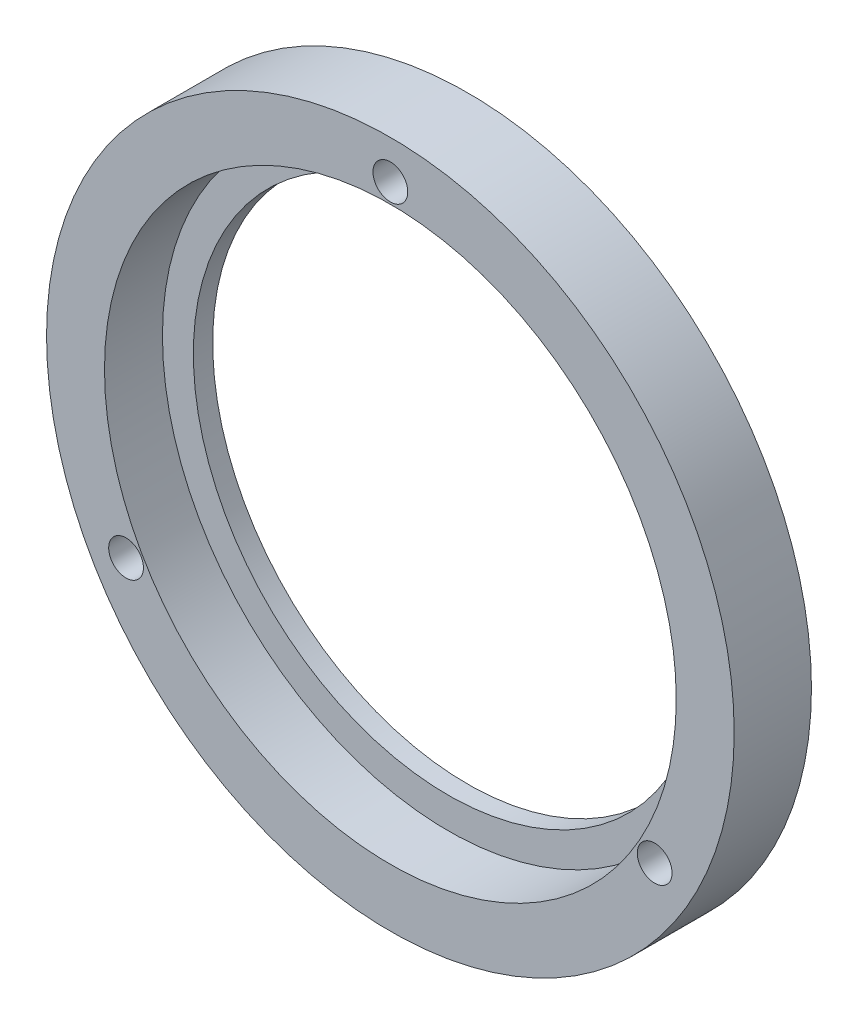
from build123d import *

# Parameters (mm, degrees)
ESQUISSE2_R                  = 2.25
ENL_V_MAT_EXTRU_1_DEPTH      = 64.722052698
R_P_TITION_CIRCULAIRE1_COUNT = 3


with BuildPart() as part:
    # Esquisse1 → Base-R_volution (revolve)
    with BuildSketch(Plane(origin=(0, 0, 0), x_dir=(1, 0, 0), z_dir=(0, 1, 0))):
        Polygon((33, 10), (44.5, 10), (44.5, 0), (37, 0), (37, 7.5), (33, 7.5), align=None)
    revolve(axis=Axis((0, 0, 30), (0, 0, -1)))

    # Esquisse2 → Enl_v. mat.-Extru.1 (cut, through all)
    with BuildSketch(Plane.XY):
        with Locations((0, 39.5)):
            Circle(ESQUISSE2_R)
    enl_v_mat_extru_1 = extrude(amount=-ENL_V_MAT_EXTRU_1_DEPTH, mode=Mode.SUBTRACT)

    # R_p_tition circulaire1: Enl_v. mat.-Extru.1 ×3 about axis
    r_p_tition_circulaire1_axis = Axis((0, 0, 30), (0, 0, -1))
    for i in range(1, R_P_TITION_CIRCULAIRE1_COUNT):
        add(enl_v_mat_extru_1.rotate(r_p_tition_circulaire1_axis, i * 360 / R_P_TITION_CIRCULAIRE1_COUNT), mode=Mode.SUBTRACT)


solid = part.part
